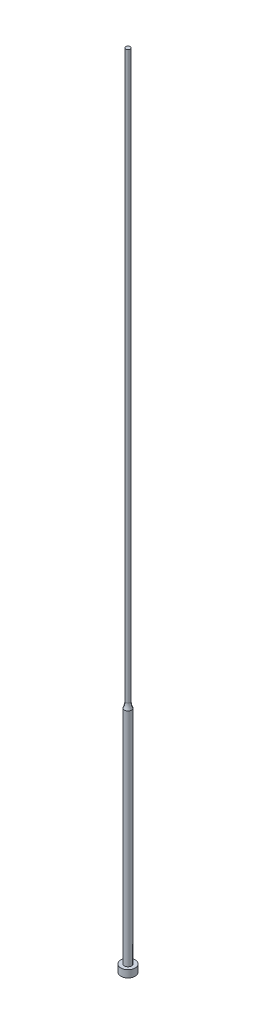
ISO-10303-21;
HEADER;
FILE_DESCRIPTION(('STEP AP214'),'2;1');
FILE_NAME('part.step','',(''),(''),'','','');
FILE_SCHEMA(('AUTOMOTIVE_DESIGN { 1 0 10303 214 1 1 1 1 }'));
ENDSEC;
DATA;
#1=APPLICATION_CONTEXT('core data for automotive mechanical design processes');
#2=APPLICATION_PROTOCOL_DEFINITION('international standard','automotive_design',2000,#1);
#3=PRODUCT_CONTEXT('',#1,'mechanical');
#4=PRODUCT('Part','Part','',(#3));
#5=PRODUCT_RELATED_PRODUCT_CATEGORY('part','',(#4));
#6=PRODUCT_DEFINITION_FORMATION('','',#4);
#7=PRODUCT_DEFINITION_CONTEXT('part definition',#1,'design');
#8=PRODUCT_DEFINITION('design','',#6,#7);
#9=PRODUCT_DEFINITION_SHAPE('','',#8);
#10=(LENGTH_UNIT() NAMED_UNIT(*) SI_UNIT(.MILLI.,.METRE.));
#11=(NAMED_UNIT(*) PLANE_ANGLE_UNIT() SI_UNIT($,.RADIAN.));
#12=(NAMED_UNIT(*) SI_UNIT($,.STERADIAN.) SOLID_ANGLE_UNIT());
#13=UNCERTAINTY_MEASURE_WITH_UNIT(LENGTH_MEASURE(1.E-05),#10,'distance_accuracy_value','');
#14=(GEOMETRIC_REPRESENTATION_CONTEXT(3) GLOBAL_UNCERTAINTY_ASSIGNED_CONTEXT((#13)) GLOBAL_UNIT_ASSIGNED_CONTEXT((#10,
#11,#12)) REPRESENTATION_CONTEXT('',''));
#15=CARTESIAN_POINT('',(0.,0.,0.));
#16=DIRECTION('',(0.,0.,1.));
#17=DIRECTION('',(1.,0.,0.));
#18=AXIS2_PLACEMENT_3D('',#15,#16,#17);
#19=CARTESIAN_POINT('',(0.,0.,0.));
#20=DIRECTION('',(0.,1.,0.));
#21=DIRECTION('',(-1.,0.,0.));
#22=AXIS2_PLACEMENT_3D('',#19,#20,#21);
#23=PLANE('',#22);
#24=CARTESIAN_POINT('',(0.,0.,0.));
#25=DIRECTION('',(0.,1.,0.));
#26=DIRECTION('',(-1.,0.,0.));
#27=AXIS2_PLACEMENT_3D('',#24,#25,#26);
#28=CIRCLE('',#27,3.175);
#29=CARTESIAN_POINT('',(-3.175,0.,0.));
#30=VERTEX_POINT('',#29);
#31=EDGE_CURVE('E37',#30,#30,#28,.T.);
#32=ORIENTED_EDGE('',*,*,#31,.F.);
#33=EDGE_LOOP('',(#32));
#34=FACE_BOUND('',#33,.T.);
#35=ADVANCED_FACE('F30',(#34),#23,.F.);
#36=CARTESIAN_POINT('',(0.,355.6,0.));
#37=DIRECTION('',(0.,1.,0.));
#38=DIRECTION('',(-1.,0.,0.));
#39=AXIS2_PLACEMENT_3D('',#36,#37,#38);
#40=CYLINDRICAL_SURFACE('',#39,3.175);
#41=CARTESIAN_POINT('',(0.,3.17499999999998,0.));
#42=DIRECTION('',(0.,1.,0.));
#43=DIRECTION('',(-1.,0.,0.));
#44=AXIS2_PLACEMENT_3D('',#41,#42,#43);
#45=CIRCLE('',#44,3.175);
#46=CARTESIAN_POINT('',(-3.175,3.17499999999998,0.));
#47=VERTEX_POINT('',#46);
#48=EDGE_CURVE('E41',#47,#47,#45,.T.);
#49=ORIENTED_EDGE('',*,*,#48,.F.);
#50=EDGE_LOOP('',(#49));
#51=FACE_BOUND('',#50,.T.);
#52=ORIENTED_EDGE('',*,*,#31,.T.);
#53=EDGE_LOOP('',(#52));
#54=FACE_BOUND('',#53,.T.);
#55=ADVANCED_FACE('F72',(#51,#54),#40,.T.);
#56=CARTESIAN_POINT('',(3.175,3.175,0.));
#57=DIRECTION('',(0.,-1.,0.));
#58=DIRECTION('',(1.,0.,0.));
#59=AXIS2_PLACEMENT_3D('',#56,#57,#58);
#60=PLANE('',#59);
#61=CARTESIAN_POINT('',(0.,3.17499999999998,0.));
#62=DIRECTION('',(0.,1.,0.));
#63=DIRECTION('',(-1.,0.,0.));
#64=AXIS2_PLACEMENT_3D('',#61,#62,#63);
#65=CIRCLE('',#64,1.58750000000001);
#66=CARTESIAN_POINT('',(-1.58750000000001,3.17499999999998,0.));
#67=VERTEX_POINT('',#66);
#68=EDGE_CURVE('E45',#67,#67,#65,.T.);
#69=ORIENTED_EDGE('',*,*,#68,.F.);
#70=EDGE_LOOP('',(#69));
#71=FACE_BOUND('',#70,.T.);
#72=ORIENTED_EDGE('',*,*,#48,.T.);
#73=EDGE_LOOP('',(#72));
#74=FACE_BOUND('',#73,.T.);
#75=ADVANCED_FACE('F68',(#71,#74),#60,.F.);
#76=CARTESIAN_POINT('',(0.,355.6,0.));
#77=DIRECTION('',(0.,1.,0.));
#78=DIRECTION('',(-1.,0.,0.));
#79=AXIS2_PLACEMENT_3D('',#76,#77,#78);
#80=CYLINDRICAL_SURFACE('',#79,1.58750000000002);
#81=CARTESIAN_POINT('',(0.,101.6,0.));
#82=DIRECTION('',(0.,1.,0.));
#83=DIRECTION('',(-1.,0.,0.));
#84=AXIS2_PLACEMENT_3D('',#81,#82,#83);
#85=CIRCLE('',#84,1.58750000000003);
#86=CARTESIAN_POINT('',(-1.58750000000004,101.6,0.));
#87=VERTEX_POINT('',#86);
#88=EDGE_CURVE('E50',#87,#87,#85,.T.);
#89=ORIENTED_EDGE('',*,*,#88,.F.);
#90=EDGE_LOOP('',(#89));
#91=FACE_BOUND('',#90,.T.);
#92=ORIENTED_EDGE('',*,*,#68,.T.);
#93=EDGE_LOOP('',(#92));
#94=FACE_BOUND('',#93,.T.);
#95=ADVANCED_FACE('F61',(#91,#94),#80,.T.);
#96=CARTESIAN_POINT('',(0.,355.6,0.));
#97=DIRECTION('',(0.,1.,0.));
#98=DIRECTION('',(-1.,0.,0.));
#99=AXIS2_PLACEMENT_3D('',#96,#97,#98);
#100=CYLINDRICAL_SURFACE('',#99,0.991870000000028);
#101=CARTESIAN_POINT('',(0.,104.285093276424,0.));
#102=DIRECTION('',(0.,-1.,0.));
#103=DIRECTION('',(1.,0.,0.));
#104=AXIS2_PLACEMENT_3D('',#101,#102,#103);
#105=CIRCLE('',#104,0.991870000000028);
#106=CARTESIAN_POINT('',(0.991870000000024,104.285093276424,0.));
#107=VERTEX_POINT('',#106);
#108=EDGE_CURVE('E10',#107,#107,#105,.F.);
#109=ORIENTED_EDGE('',*,*,#108,.T.);
#110=EDGE_LOOP('',(#109));
#111=FACE_BOUND('',#110,.T.);
#112=CARTESIAN_POINT('',(0.,355.6,0.));
#113=DIRECTION('',(0.,1.,0.));
#114=DIRECTION('',(-1.,0.,0.));
#115=AXIS2_PLACEMENT_3D('',#112,#113,#114);
#116=CIRCLE('',#115,0.991870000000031);
#117=CARTESIAN_POINT('',(-0.991870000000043,355.6,0.));
#118=VERTEX_POINT('',#117);
#119=EDGE_CURVE('E53',#118,#118,#116,.T.);
#120=ORIENTED_EDGE('',*,*,#119,.F.);
#121=EDGE_LOOP('',(#120));
#122=FACE_BOUND('',#121,.T.);
#123=ADVANCED_FACE('F59',(#111,#122),#100,.T.);
#124=CARTESIAN_POINT('',(0.991870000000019,355.6,0.));
#125=DIRECTION('',(0.,-1.,0.));
#126=DIRECTION('',(1.,0.,0.));
#127=AXIS2_PLACEMENT_3D('',#124,#125,#126);
#128=PLANE('',#127);
#129=ORIENTED_EDGE('',*,*,#119,.T.);
#130=EDGE_LOOP('',(#129));
#131=FACE_BOUND('',#130,.T.);
#132=ADVANCED_FACE('F57',(#131),#128,.F.);
#133=CARTESIAN_POINT('',(0.,104.285093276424,0.));
#134=DIRECTION('',(0.,-1.,0.));
#135=DIRECTION('',(1.,0.,0.));
#136=AXIS2_PLACEMENT_3D('',#133,#134,#135);
#137=TOROIDAL_SURFACE('',#136,7.34187000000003,6.35);
#138=ORIENTED_EDGE('',*,*,#88,.T.);
#139=EDGE_LOOP('',(#138));
#140=FACE_BOUND('',#139,.T.);
#141=ORIENTED_EDGE('',*,*,#108,.F.);
#142=EDGE_LOOP('',(#141));
#143=FACE_BOUND('',#142,.T.);
#144=ADVANCED_FACE('F32',(#140,#143),#137,.F.);
#145=CLOSED_SHELL('',(#35,#55,#75,#95,#123,#132,#144));
#146=MANIFOLD_SOLID_BREP('B2',#145);
#147=ADVANCED_BREP_SHAPE_REPRESENTATION('',(#18,#146),#14);
#148=SHAPE_DEFINITION_REPRESENTATION(#9,#147);
ENDSEC;
END-ISO-10303-21;
